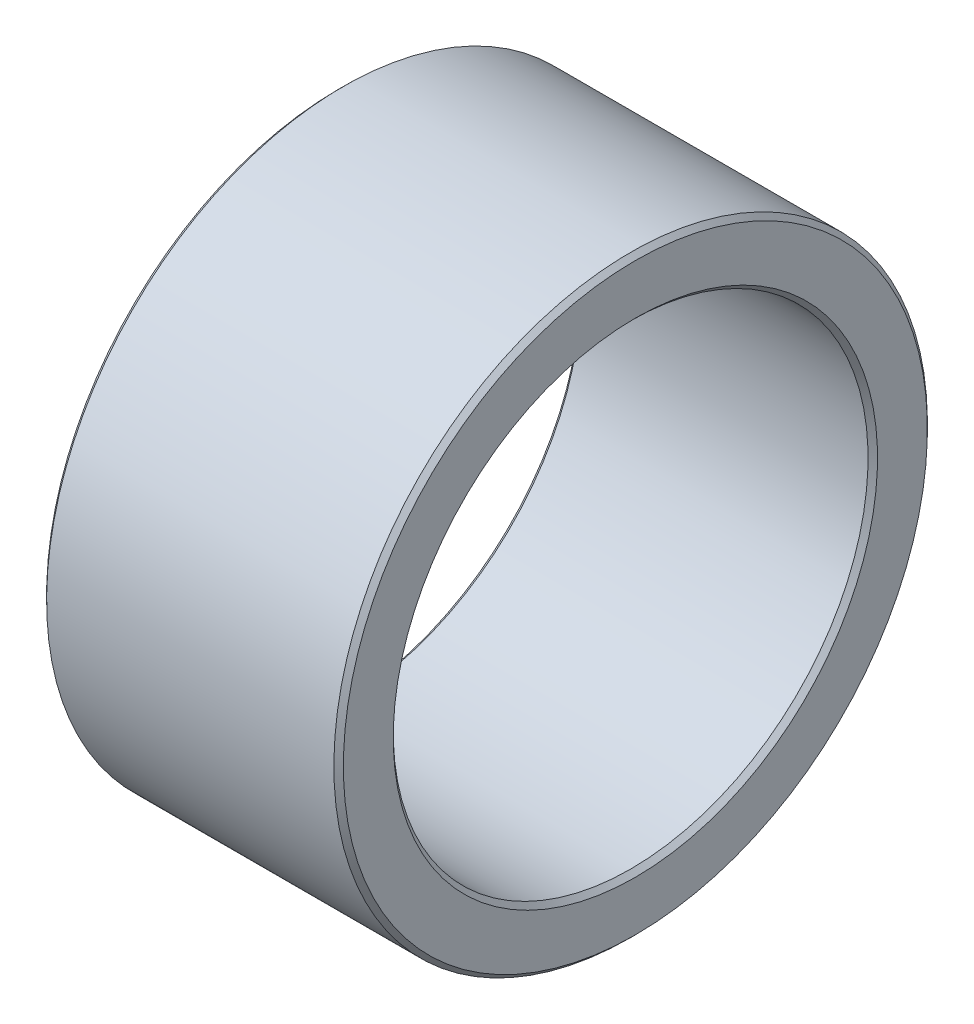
ISO-10303-21;
HEADER;
FILE_DESCRIPTION(('STEP AP214'),'2;1');
FILE_NAME('part.step','',(''),(''),'','','');
FILE_SCHEMA(('AUTOMOTIVE_DESIGN { 1 0 10303 214 1 1 1 1 }'));
ENDSEC;
DATA;
#1=APPLICATION_CONTEXT('core data for automotive mechanical design processes');
#2=APPLICATION_PROTOCOL_DEFINITION('international standard','automotive_design',2000,#1);
#3=PRODUCT_CONTEXT('',#1,'mechanical');
#4=PRODUCT('Part','Part','',(#3));
#5=PRODUCT_RELATED_PRODUCT_CATEGORY('part','',(#4));
#6=PRODUCT_DEFINITION_FORMATION('','',#4);
#7=PRODUCT_DEFINITION_CONTEXT('part definition',#1,'design');
#8=PRODUCT_DEFINITION('design','',#6,#7);
#9=PRODUCT_DEFINITION_SHAPE('','',#8);
#10=(LENGTH_UNIT() NAMED_UNIT(*) SI_UNIT(.MILLI.,.METRE.));
#11=(NAMED_UNIT(*) PLANE_ANGLE_UNIT() SI_UNIT($,.RADIAN.));
#12=(NAMED_UNIT(*) SI_UNIT($,.STERADIAN.) SOLID_ANGLE_UNIT());
#13=UNCERTAINTY_MEASURE_WITH_UNIT(LENGTH_MEASURE(1.E-05),#10,'distance_accuracy_value','');
#14=(GEOMETRIC_REPRESENTATION_CONTEXT(3) GLOBAL_UNCERTAINTY_ASSIGNED_CONTEXT((#13)) GLOBAL_UNIT_ASSIGNED_CONTEXT((#10,
#11,#12)) REPRESENTATION_CONTEXT('',''));
#15=CARTESIAN_POINT('',(0.,0.,0.));
#16=DIRECTION('',(0.,0.,1.));
#17=DIRECTION('',(1.,0.,0.));
#18=AXIS2_PLACEMENT_3D('',#15,#16,#17);
#19=CARTESIAN_POINT('',(0.,-22.5,0.));
#20=DIRECTION('',(-1.,0.,0.));
#21=DIRECTION('',(0.,1.,0.));
#22=AXIS2_PLACEMENT_3D('',#19,#20,#21);
#23=PLANE('',#22);
#24=CARTESIAN_POINT('',(0.,0.,0.));
#25=DIRECTION('',(1.,0.,0.));
#26=DIRECTION('',(0.,-1.,0.));
#27=AXIS2_PLACEMENT_3D('',#24,#25,#26);
#28=CIRCLE('',#27,20.4);
#29=CARTESIAN_POINT('',(0.,-20.4,0.));
#30=VERTEX_POINT('',#29);
#31=EDGE_CURVE('E9',#30,#30,#28,.T.);
#32=ORIENTED_EDGE('',*,*,#31,.T.);
#33=EDGE_LOOP('',(#32));
#34=FACE_BOUND('',#33,.T.);
#35=CARTESIAN_POINT('',(0.,0.,0.));
#36=DIRECTION('',(1.,0.,0.));
#37=DIRECTION('',(0.,-1.,0.));
#38=AXIS2_PLACEMENT_3D('',#35,#36,#37);
#39=CIRCLE('',#38,24.6);
#40=CARTESIAN_POINT('',(0.,-24.6,0.));
#41=VERTEX_POINT('',#40);
#42=EDGE_CURVE('E53',#41,#41,#39,.T.);
#43=ORIENTED_EDGE('',*,*,#42,.F.);
#44=EDGE_LOOP('',(#43));
#45=FACE_BOUND('',#44,.T.);
#46=ADVANCED_FACE('F15',(#34,#45),#23,.T.);
#47=CARTESIAN_POINT('',(0.2,0.,0.));
#48=DIRECTION('',(-1.,0.,0.));
#49=DIRECTION('',(0.,-1.,0.));
#50=AXIS2_PLACEMENT_3D('',#47,#48,#49);
#51=CONICAL_SURFACE('',#50,20.2,0.78539816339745);
#52=CARTESIAN_POINT('',(0.4,0.,0.));
#53=DIRECTION('',(1.,0.,0.));
#54=DIRECTION('',(0.,-1.,0.));
#55=AXIS2_PLACEMENT_3D('',#52,#53,#54);
#56=CIRCLE('',#55,20.);
#57=CARTESIAN_POINT('',(0.4,-20.,0.));
#58=VERTEX_POINT('',#57);
#59=EDGE_CURVE('E22',#58,#58,#56,.T.);
#60=ORIENTED_EDGE('',*,*,#59,.T.);
#61=EDGE_LOOP('',(#60));
#62=FACE_BOUND('',#61,.T.);
#63=ORIENTED_EDGE('',*,*,#31,.F.);
#64=EDGE_LOOP('',(#63));
#65=FACE_BOUND('',#64,.T.);
#66=ADVANCED_FACE('F82',(#62,#65),#51,.F.);
#67=CARTESIAN_POINT('',(12.5,0.,0.));
#68=DIRECTION('',(-1.,0.,0.));
#69=DIRECTION('',(0.,-1.,0.));
#70=AXIS2_PLACEMENT_3D('',#67,#68,#69);
#71=CYLINDRICAL_SURFACE('',#70,20.);
#72=CARTESIAN_POINT('',(24.6,0.,0.));
#73=DIRECTION('',(1.,0.,0.));
#74=DIRECTION('',(0.,-1.,0.));
#75=AXIS2_PLACEMENT_3D('',#72,#73,#74);
#76=CIRCLE('',#75,20.);
#77=CARTESIAN_POINT('',(24.6,-20.,0.));
#78=VERTEX_POINT('',#77);
#79=EDGE_CURVE('E58',#78,#78,#76,.T.);
#80=ORIENTED_EDGE('',*,*,#79,.T.);
#81=EDGE_LOOP('',(#80));
#82=FACE_BOUND('',#81,.T.);
#83=ORIENTED_EDGE('',*,*,#59,.F.);
#84=EDGE_LOOP('',(#83));
#85=FACE_BOUND('',#84,.T.);
#86=ADVANCED_FACE('F66',(#82,#85),#71,.F.);
#87=CARTESIAN_POINT('',(24.8,0.,0.));
#88=DIRECTION('',(1.,0.,0.));
#89=DIRECTION('',(0.,-1.,0.));
#90=AXIS2_PLACEMENT_3D('',#87,#88,#89);
#91=CONICAL_SURFACE('',#90,20.2,0.785398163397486);
#92=CARTESIAN_POINT('',(25.,0.,0.));
#93=DIRECTION('',(1.,0.,0.));
#94=DIRECTION('',(0.,-1.,0.));
#95=AXIS2_PLACEMENT_3D('',#92,#93,#94);
#96=CIRCLE('',#95,20.4);
#97=CARTESIAN_POINT('',(25.,-20.4,0.));
#98=VERTEX_POINT('',#97);
#99=EDGE_CURVE('E63',#98,#98,#96,.T.);
#100=ORIENTED_EDGE('',*,*,#99,.T.);
#101=EDGE_LOOP('',(#100));
#102=FACE_BOUND('',#101,.T.);
#103=ORIENTED_EDGE('',*,*,#79,.F.);
#104=EDGE_LOOP('',(#103));
#105=FACE_BOUND('',#104,.T.);
#106=ADVANCED_FACE('F69',(#102,#105),#91,.F.);
#107=CARTESIAN_POINT('',(25.,-22.5,0.));
#108=DIRECTION('',(1.,0.,0.));
#109=DIRECTION('',(0.,-1.,0.));
#110=AXIS2_PLACEMENT_3D('',#107,#108,#109);
#111=PLANE('',#110);
#112=CARTESIAN_POINT('',(25.,0.,0.));
#113=DIRECTION('',(1.,0.,0.));
#114=DIRECTION('',(0.,-1.,0.));
#115=AXIS2_PLACEMENT_3D('',#112,#113,#114);
#116=CIRCLE('',#115,24.6);
#117=CARTESIAN_POINT('',(25.,-24.6,0.));
#118=VERTEX_POINT('',#117);
#119=EDGE_CURVE('E61',#118,#118,#116,.T.);
#120=ORIENTED_EDGE('',*,*,#119,.T.);
#121=EDGE_LOOP('',(#120));
#122=FACE_BOUND('',#121,.T.);
#123=ORIENTED_EDGE('',*,*,#99,.F.);
#124=EDGE_LOOP('',(#123));
#125=FACE_BOUND('',#124,.T.);
#126=ADVANCED_FACE('F71',(#122,#125),#111,.T.);
#127=CARTESIAN_POINT('',(24.8,0.,0.));
#128=DIRECTION('',(-1.,0.,0.));
#129=DIRECTION('',(0.,-1.,0.));
#130=AXIS2_PLACEMENT_3D('',#127,#128,#129);
#131=CONICAL_SURFACE('',#130,24.8,0.785398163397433);
#132=CARTESIAN_POINT('',(24.6,0.,0.));
#133=DIRECTION('',(1.,0.,0.));
#134=DIRECTION('',(0.,-1.,0.));
#135=AXIS2_PLACEMENT_3D('',#132,#133,#134);
#136=CIRCLE('',#135,25.);
#137=CARTESIAN_POINT('',(24.6,-25.,0.));
#138=VERTEX_POINT('',#137);
#139=EDGE_CURVE('E55',#138,#138,#136,.T.);
#140=ORIENTED_EDGE('',*,*,#139,.T.);
#141=EDGE_LOOP('',(#140));
#142=FACE_BOUND('',#141,.T.);
#143=ORIENTED_EDGE('',*,*,#119,.F.);
#144=EDGE_LOOP('',(#143));
#145=FACE_BOUND('',#144,.T.);
#146=ADVANCED_FACE('F79',(#142,#145),#131,.T.);
#147=CARTESIAN_POINT('',(12.5,0.,0.));
#148=DIRECTION('',(-1.,0.,0.));
#149=DIRECTION('',(0.,-1.,0.));
#150=AXIS2_PLACEMENT_3D('',#147,#148,#149);
#151=CYLINDRICAL_SURFACE('',#150,25.);
#152=CARTESIAN_POINT('',(0.4,0.,0.));
#153=DIRECTION('',(1.,0.,0.));
#154=DIRECTION('',(0.,-1.,0.));
#155=AXIS2_PLACEMENT_3D('',#152,#153,#154);
#156=CIRCLE('',#155,25.);
#157=CARTESIAN_POINT('',(0.4,-25.,0.));
#158=VERTEX_POINT('',#157);
#159=EDGE_CURVE('E49',#158,#158,#156,.T.);
#160=ORIENTED_EDGE('',*,*,#159,.T.);
#161=EDGE_LOOP('',(#160));
#162=FACE_BOUND('',#161,.T.);
#163=ORIENTED_EDGE('',*,*,#139,.F.);
#164=EDGE_LOOP('',(#163));
#165=FACE_BOUND('',#164,.T.);
#166=ADVANCED_FACE('F50',(#162,#165),#151,.T.);
#167=CARTESIAN_POINT('',(0.2,0.,0.));
#168=DIRECTION('',(1.,0.,0.));
#169=DIRECTION('',(0.,-1.,0.));
#170=AXIS2_PLACEMENT_3D('',#167,#168,#169);
#171=CONICAL_SURFACE('',#170,24.8,0.78539816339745);
#172=ORIENTED_EDGE('',*,*,#42,.T.);
#173=EDGE_LOOP('',(#172));
#174=FACE_BOUND('',#173,.T.);
#175=ORIENTED_EDGE('',*,*,#159,.F.);
#176=EDGE_LOOP('',(#175));
#177=FACE_BOUND('',#176,.T.);
#178=ADVANCED_FACE('F92',(#174,#177),#171,.T.);
#179=CLOSED_SHELL('',(#46,#66,#86,#106,#126,#146,#166,#178));
#180=MANIFOLD_SOLID_BREP('B1',#179);
#181=ADVANCED_BREP_SHAPE_REPRESENTATION('',(#18,#180),#14);
#182=SHAPE_DEFINITION_REPRESENTATION(#9,#181);
ENDSEC;
END-ISO-10303-21;
